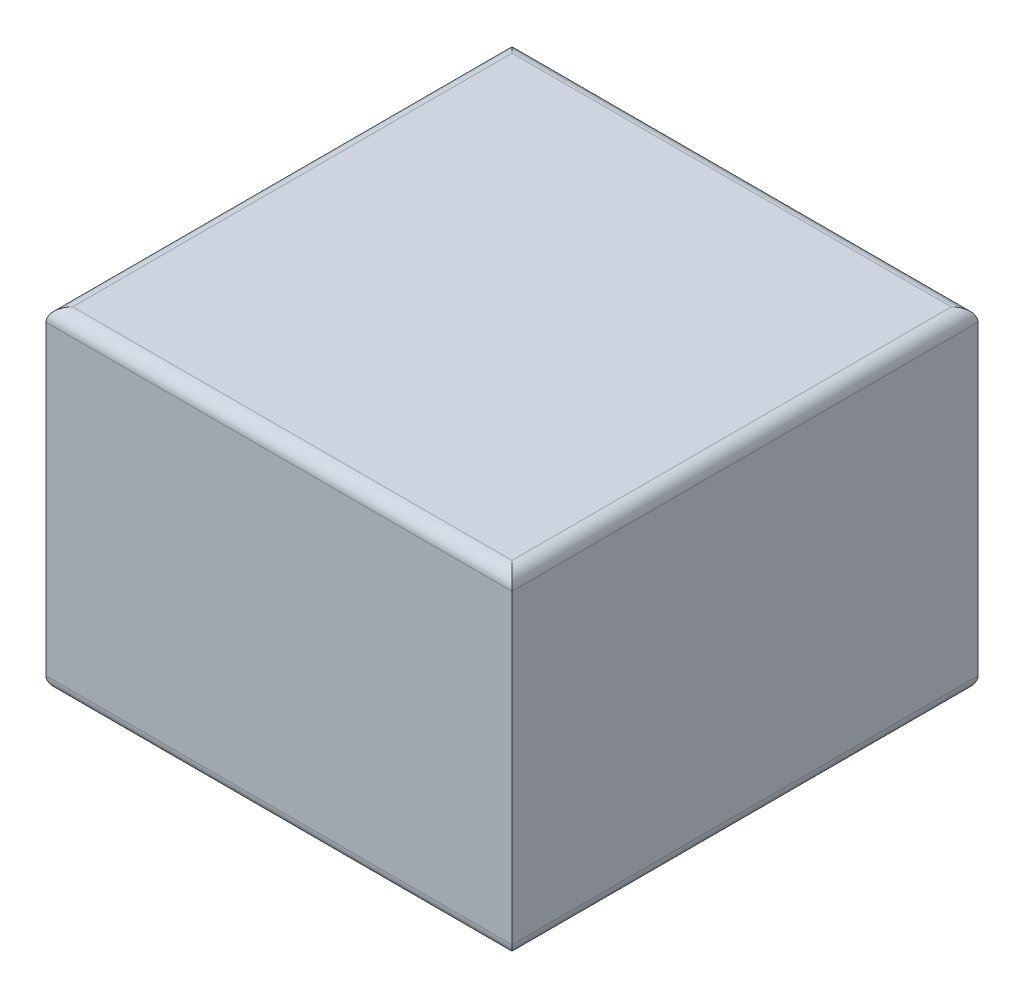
from build123d import *

# Parameters (mm, degrees)
SKETCH1_W           = 35
SKETCH1_H           = 35
BOSS_EXTRUDE1_DEPTH = 25
FILLET1_R           = 1


with BuildPart() as part:
    # Sketch1 → Boss-Extrude1 (new body)
    with BuildSketch(Plane(origin=(0, 0, 0), x_dir=(1, 0, 0), z_dir=(0, 1, 0))):
        with Locations((17.5, 17.5)):
            Rectangle(SKETCH1_W, SKETCH1_H)
    extrude(amount=BOSS_EXTRUDE1_DEPTH)

    # Fillet1
    fillet1_edges = [part.edges().sort_by_distance(p)[0] for p in [
        (35, 25, -17.5),
        (17.5, 25, -35),
        (0, 25, -17.5),
        (17.5, 0, -35),
        (35, 0, -17.5),
        (17.5, 0, 0),
        (0, 0, -17.5),
        (17.5, 25, 0),
    ]]
    fillet(fillet1_edges, radius=FILLET1_R)


solid = part.part
